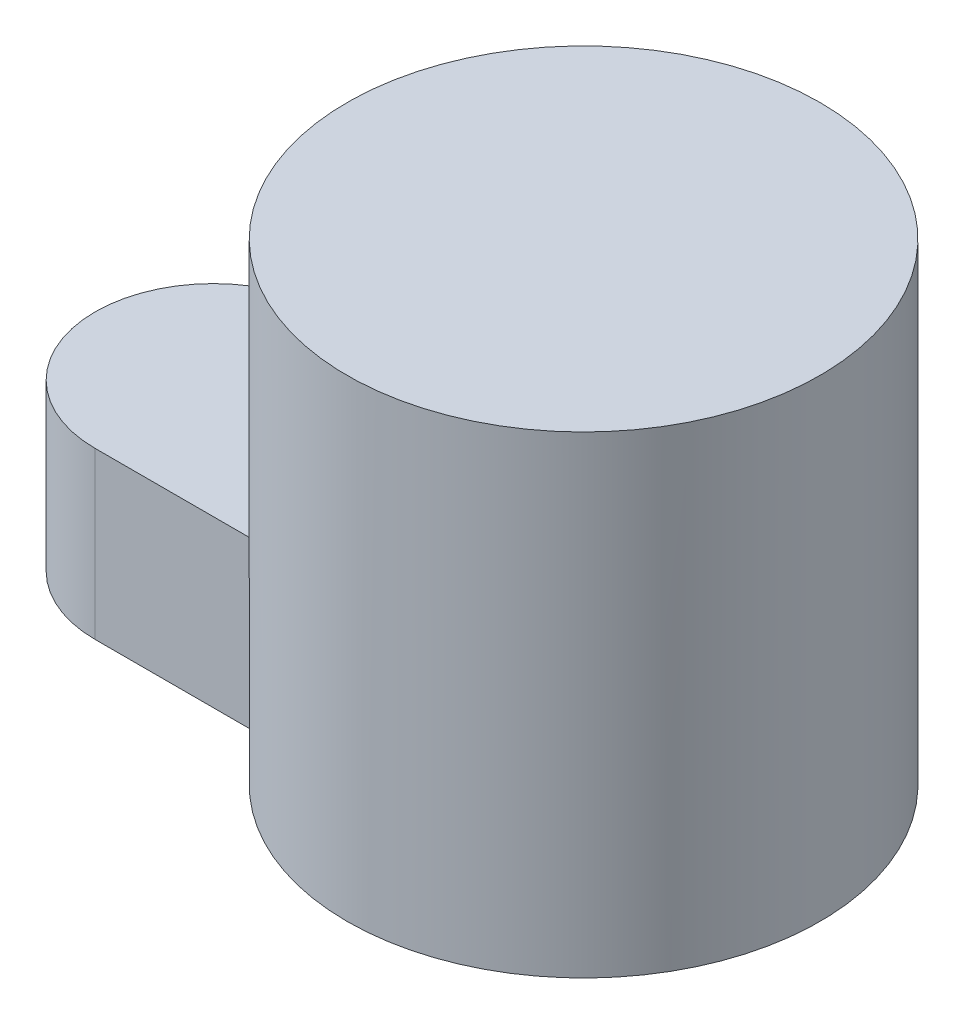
ISO-10303-21;
HEADER;
FILE_DESCRIPTION(('STEP AP214'),'2;1');
FILE_NAME('part.step','',(''),(''),'','','');
FILE_SCHEMA(('AUTOMOTIVE_DESIGN { 1 0 10303 214 1 1 1 1 }'));
ENDSEC;
DATA;
#1=APPLICATION_CONTEXT('core data for automotive mechanical design processes');
#2=APPLICATION_PROTOCOL_DEFINITION('international standard','automotive_design',2000,#1);
#3=PRODUCT_CONTEXT('',#1,'mechanical');
#4=PRODUCT('Part','Part','',(#3));
#5=PRODUCT_RELATED_PRODUCT_CATEGORY('part','',(#4));
#6=PRODUCT_DEFINITION_FORMATION('','',#4);
#7=PRODUCT_DEFINITION_CONTEXT('part definition',#1,'design');
#8=PRODUCT_DEFINITION('design','',#6,#7);
#9=PRODUCT_DEFINITION_SHAPE('','',#8);
#10=(LENGTH_UNIT() NAMED_UNIT(*) SI_UNIT(.MILLI.,.METRE.));
#11=(NAMED_UNIT(*) PLANE_ANGLE_UNIT() SI_UNIT($,.RADIAN.));
#12=(NAMED_UNIT(*) SI_UNIT($,.STERADIAN.) SOLID_ANGLE_UNIT());
#13=UNCERTAINTY_MEASURE_WITH_UNIT(LENGTH_MEASURE(1.E-05),#10,'distance_accuracy_value','');
#14=(GEOMETRIC_REPRESENTATION_CONTEXT(3) GLOBAL_UNCERTAINTY_ASSIGNED_CONTEXT((#13)) GLOBAL_UNIT_ASSIGNED_CONTEXT((#10,
#11,#12)) REPRESENTATION_CONTEXT('',''));
#15=CARTESIAN_POINT('',(0.,0.,0.));
#16=DIRECTION('',(0.,0.,1.));
#17=DIRECTION('',(1.,0.,0.));
#18=AXIS2_PLACEMENT_3D('',#15,#16,#17);
#19=CARTESIAN_POINT('',(0.,100.,0.));
#20=DIRECTION('',(0.,-1.,0.));
#21=DIRECTION('',(0.,0.,-1.));
#22=AXIS2_PLACEMENT_3D('',#19,#20,#21);
#23=CYLINDRICAL_SURFACE('',#22,50.);
#24=DIRECTION('',(0.,-1.,0.));
#25=VECTOR('',#24,1.);
#26=CARTESIAN_POINT('',(-43.3012701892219,35.,-25.));
#27=LINE('',#26,#25);
#28=CARTESIAN_POINT('',(-43.3012701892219,35.,-25.));
#29=VERTEX_POINT('',#28);
#30=CARTESIAN_POINT('',(-43.3012701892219,0.,-25.));
#31=VERTEX_POINT('',#30);
#32=EDGE_CURVE('E86',#29,#31,#27,.T.);
#33=ORIENTED_EDGE('',*,*,#32,.F.);
#34=CARTESIAN_POINT('',(0.,35.,0.));
#35=DIRECTION('',(0.,-1.,0.));
#36=DIRECTION('',(0.,0.,-1.));
#37=AXIS2_PLACEMENT_3D('',#34,#35,#36);
#38=CIRCLE('',#37,50.);
#39=CARTESIAN_POINT('',(-43.3012701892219,35.,25.));
#40=VERTEX_POINT('',#39);
#41=EDGE_CURVE('E75',#40,#29,#38,.T.);
#42=ORIENTED_EDGE('',*,*,#41,.F.);
#43=DIRECTION('',(0.,-1.,0.));
#44=VECTOR('',#43,1.);
#45=CARTESIAN_POINT('',(-43.3012701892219,35.,25.));
#46=LINE('',#45,#44);
#47=CARTESIAN_POINT('',(-43.3012701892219,0.,25.));
#48=VERTEX_POINT('',#47);
#49=EDGE_CURVE('E54',#40,#48,#46,.T.);
#50=ORIENTED_EDGE('',*,*,#49,.T.);
#51=CARTESIAN_POINT('',(0.,0.,0.));
#52=DIRECTION('',(0.,-1.,0.));
#53=DIRECTION('',(0.,0.,-1.));
#54=AXIS2_PLACEMENT_3D('',#51,#52,#53);
#55=CIRCLE('',#54,50.);
#56=EDGE_CURVE('E34',#31,#48,#55,.T.);
#57=ORIENTED_EDGE('',*,*,#56,.F.);
#58=EDGE_LOOP('',(#33,#42,#50,#57));
#59=FACE_BOUND('',#58,.T.);
#60=CARTESIAN_POINT('',(0.,100.,0.));
#61=DIRECTION('',(0.,-1.,0.));
#62=DIRECTION('',(0.,0.,-1.));
#63=AXIS2_PLACEMENT_3D('',#60,#61,#62);
#64=CIRCLE('',#63,50.);
#65=CARTESIAN_POINT('',(0.,100.,-50.));
#66=VERTEX_POINT('',#65);
#67=EDGE_CURVE('E11',#66,#66,#64,.T.);
#68=ORIENTED_EDGE('',*,*,#67,.T.);
#69=EDGE_LOOP('',(#68));
#70=FACE_BOUND('',#69,.T.);
#71=ADVANCED_FACE('F31',(#59,#70),#23,.T.);
#72=CARTESIAN_POINT('',(-26.650635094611,100.,-142.508110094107));
#73=DIRECTION('',(0.,-1.,0.));
#74=DIRECTION('',(0.,0.,-1.));
#75=AXIS2_PLACEMENT_3D('',#72,#73,#74);
#76=PLANE('',#75);
#77=ORIENTED_EDGE('',*,*,#67,.F.);
#78=EDGE_LOOP('',(#77));
#79=FACE_BOUND('',#78,.T.);
#80=ADVANCED_FACE('F110',(#79),#76,.F.);
#81=CARTESIAN_POINT('',(-26.650635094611,0.,-142.508110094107));
#82=DIRECTION('',(0.,-1.,0.));
#83=DIRECTION('',(0.,0.,-1.));
#84=AXIS2_PLACEMENT_3D('',#81,#82,#83);
#85=PLANE('',#84);
#86=ORIENTED_EDGE('',*,*,#56,.T.);
#87=DIRECTION('',(-1.,0.,0.));
#88=VECTOR('',#87,1.);
#89=CARTESIAN_POINT('',(-26.650635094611,0.,25.));
#90=LINE('',#89,#88);
#91=CARTESIAN_POINT('',(-78.3012701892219,0.,25.));
#92=VERTEX_POINT('',#91);
#93=EDGE_CURVE('E69',#48,#92,#90,.T.);
#94=ORIENTED_EDGE('',*,*,#93,.T.);
#95=CARTESIAN_POINT('',(-78.3012701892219,0.,0.));
#96=DIRECTION('',(0.,-1.,0.));
#97=DIRECTION('',(0.,0.,-1.));
#98=AXIS2_PLACEMENT_3D('',#95,#96,#97);
#99=CIRCLE('',#98,25.);
#100=CARTESIAN_POINT('',(-78.3012701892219,0.,-25.));
#101=VERTEX_POINT('',#100);
#102=EDGE_CURVE('E100',#92,#101,#99,.T.);
#103=ORIENTED_EDGE('',*,*,#102,.T.);
#104=DIRECTION('',(1.,0.,0.));
#105=VECTOR('',#104,1.);
#106=CARTESIAN_POINT('',(-26.650635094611,0.,-25.));
#107=LINE('',#106,#105);
#108=EDGE_CURVE('E45',#101,#31,#107,.T.);
#109=ORIENTED_EDGE('',*,*,#108,.T.);
#110=EDGE_LOOP('',(#86,#94,#103,#109));
#111=FACE_BOUND('',#110,.T.);
#112=ADVANCED_FACE('F106',(#111),#85,.T.);
#113=CARTESIAN_POINT('',(-26.650635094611,35.,-25.));
#114=DIRECTION('',(0.,0.,-1.));
#115=DIRECTION('',(-1.,0.,0.));
#116=AXIS2_PLACEMENT_3D('',#113,#114,#115);
#117=PLANE('',#116);
#118=ORIENTED_EDGE('',*,*,#108,.F.);
#119=DIRECTION('',(0.,-1.,0.));
#120=VECTOR('',#119,1.);
#121=CARTESIAN_POINT('',(-78.3012701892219,35.,-25.));
#122=LINE('',#121,#120);
#123=CARTESIAN_POINT('',(-78.3012701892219,35.,-25.));
#124=VERTEX_POINT('',#123);
#125=EDGE_CURVE('E79',#124,#101,#122,.T.);
#126=ORIENTED_EDGE('',*,*,#125,.F.);
#127=DIRECTION('',(1.,0.,0.));
#128=VECTOR('',#127,1.);
#129=CARTESIAN_POINT('',(-26.650635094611,35.,-25.));
#130=LINE('',#129,#128);
#131=EDGE_CURVE('E81',#124,#29,#130,.T.);
#132=ORIENTED_EDGE('',*,*,#131,.T.);
#133=ORIENTED_EDGE('',*,*,#32,.T.);
#134=EDGE_LOOP('',(#118,#126,#132,#133));
#135=FACE_BOUND('',#134,.T.);
#136=ADVANCED_FACE('F80',(#135),#117,.T.);
#137=CARTESIAN_POINT('',(-78.3012701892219,35.,0.));
#138=DIRECTION('',(0.,-1.,0.));
#139=DIRECTION('',(0.,0.,-1.));
#140=AXIS2_PLACEMENT_3D('',#137,#138,#139);
#141=CYLINDRICAL_SURFACE('',#140,25.);
#142=ORIENTED_EDGE('',*,*,#102,.F.);
#143=DIRECTION('',(0.,-1.,0.));
#144=VECTOR('',#143,1.);
#145=CARTESIAN_POINT('',(-78.3012701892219,35.,25.));
#146=LINE('',#145,#144);
#147=CARTESIAN_POINT('',(-78.3012701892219,35.,25.));
#148=VERTEX_POINT('',#147);
#149=EDGE_CURVE('E87',#148,#92,#146,.T.);
#150=ORIENTED_EDGE('',*,*,#149,.F.);
#151=CARTESIAN_POINT('',(-78.3012701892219,35.,0.));
#152=DIRECTION('',(0.,-1.,0.));
#153=DIRECTION('',(0.,0.,-1.));
#154=AXIS2_PLACEMENT_3D('',#151,#152,#153);
#155=CIRCLE('',#154,25.);
#156=EDGE_CURVE('E91',#148,#124,#155,.T.);
#157=ORIENTED_EDGE('',*,*,#156,.T.);
#158=ORIENTED_EDGE('',*,*,#125,.T.);
#159=EDGE_LOOP('',(#142,#150,#157,#158));
#160=FACE_BOUND('',#159,.T.);
#161=ADVANCED_FACE('F93',(#160),#141,.T.);
#162=CARTESIAN_POINT('',(-26.650635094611,35.,25.));
#163=DIRECTION('',(0.,0.,1.));
#164=DIRECTION('',(1.,0.,0.));
#165=AXIS2_PLACEMENT_3D('',#162,#163,#164);
#166=PLANE('',#165);
#167=ORIENTED_EDGE('',*,*,#93,.F.);
#168=ORIENTED_EDGE('',*,*,#49,.F.);
#169=DIRECTION('',(-1.,0.,0.));
#170=VECTOR('',#169,1.);
#171=CARTESIAN_POINT('',(-26.650635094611,35.,25.));
#172=LINE('',#171,#170);
#173=EDGE_CURVE('E94',#40,#148,#172,.T.);
#174=ORIENTED_EDGE('',*,*,#173,.T.);
#175=ORIENTED_EDGE('',*,*,#149,.T.);
#176=EDGE_LOOP('',(#167,#168,#174,#175));
#177=FACE_BOUND('',#176,.T.);
#178=ADVANCED_FACE('F123',(#177),#166,.T.);
#179=CARTESIAN_POINT('',(-26.650635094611,35.,-142.508110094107));
#180=DIRECTION('',(0.,-1.,0.));
#181=DIRECTION('',(0.,0.,-1.));
#182=AXIS2_PLACEMENT_3D('',#179,#180,#181);
#183=PLANE('',#182);
#184=ORIENTED_EDGE('',*,*,#41,.T.);
#185=ORIENTED_EDGE('',*,*,#131,.F.);
#186=ORIENTED_EDGE('',*,*,#156,.F.);
#187=ORIENTED_EDGE('',*,*,#173,.F.);
#188=EDGE_LOOP('',(#184,#185,#186,#187));
#189=FACE_BOUND('',#188,.T.);
#190=ADVANCED_FACE('F90',(#189),#183,.F.);
#191=CLOSED_SHELL('',(#71,#80,#112,#136,#161,#178,#190));
#192=MANIFOLD_SOLID_BREP('B2',#191);
#193=ADVANCED_BREP_SHAPE_REPRESENTATION('',(#18,#192),#14);
#194=SHAPE_DEFINITION_REPRESENTATION(#9,#193);
ENDSEC;
END-ISO-10303-21;
